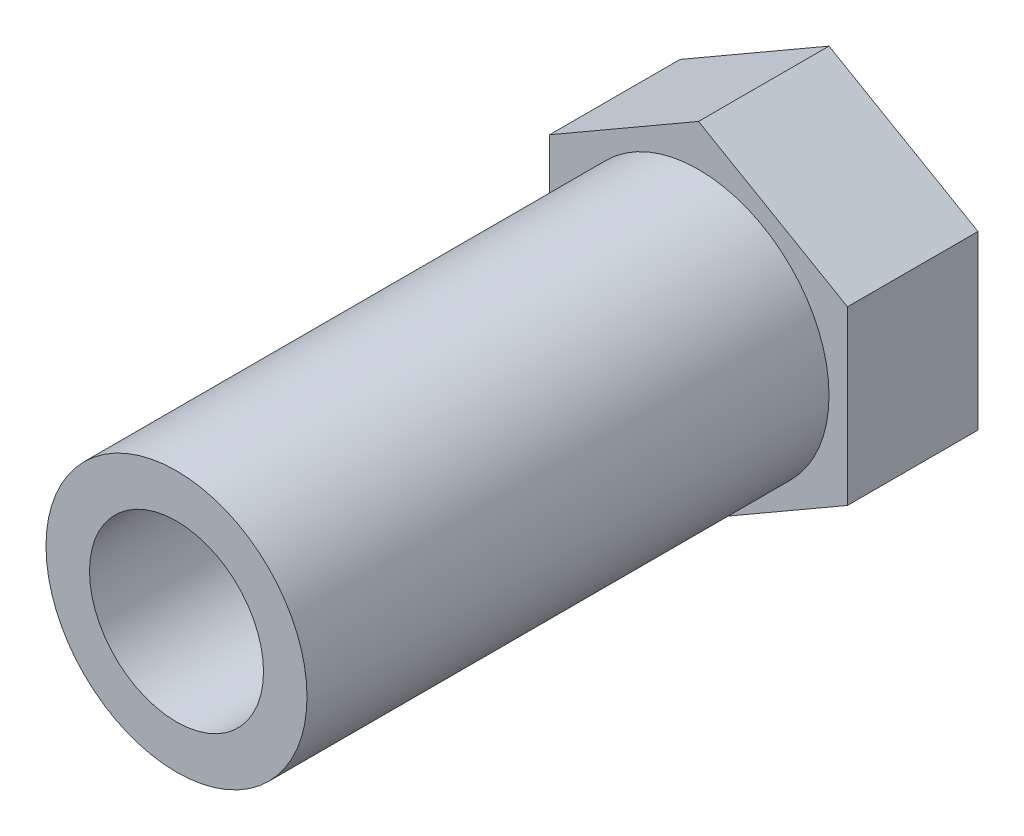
ISO-10303-21;
HEADER;
FILE_DESCRIPTION(('STEP AP214'),'2;1');
FILE_NAME('part.step','',(''),(''),'','','');
FILE_SCHEMA(('AUTOMOTIVE_DESIGN { 1 0 10303 214 1 1 1 1 }'));
ENDSEC;
DATA;
#1=APPLICATION_CONTEXT('core data for automotive mechanical design processes');
#2=APPLICATION_PROTOCOL_DEFINITION('international standard','automotive_design',2000,#1);
#3=PRODUCT_CONTEXT('',#1,'mechanical');
#4=PRODUCT('Part','Part','',(#3));
#5=PRODUCT_RELATED_PRODUCT_CATEGORY('part','',(#4));
#6=PRODUCT_DEFINITION_FORMATION('','',#4);
#7=PRODUCT_DEFINITION_CONTEXT('part definition',#1,'design');
#8=PRODUCT_DEFINITION('design','',#6,#7);
#9=PRODUCT_DEFINITION_SHAPE('','',#8);
#10=(LENGTH_UNIT() NAMED_UNIT(*) SI_UNIT(.MILLI.,.METRE.));
#11=(NAMED_UNIT(*) PLANE_ANGLE_UNIT() SI_UNIT($,.RADIAN.));
#12=(NAMED_UNIT(*) SI_UNIT($,.STERADIAN.) SOLID_ANGLE_UNIT());
#13=UNCERTAINTY_MEASURE_WITH_UNIT(LENGTH_MEASURE(1.E-05),#10,'distance_accuracy_value','');
#14=(GEOMETRIC_REPRESENTATION_CONTEXT(3) GLOBAL_UNCERTAINTY_ASSIGNED_CONTEXT((#13)) GLOBAL_UNIT_ASSIGNED_CONTEXT((#10,
#11,#12)) REPRESENTATION_CONTEXT('',''));
#15=CARTESIAN_POINT('',(0.,0.,0.));
#16=DIRECTION('',(0.,0.,1.));
#17=DIRECTION('',(1.,0.,0.));
#18=AXIS2_PLACEMENT_3D('',#15,#16,#17);
#19=CARTESIAN_POINT('',(6.84999999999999,3.95484934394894,6.));
#20=DIRECTION('',(-0.5,-0.866025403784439,0.));
#21=DIRECTION('',(0.866025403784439,-0.5,0.));
#22=AXIS2_PLACEMENT_3D('',#19,#20,#21);
#23=PLANE('',#22);
#24=DIRECTION('',(-0.866025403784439,0.5,0.));
#25=VECTOR('',#24,1.);
#26=CARTESIAN_POINT('',(6.84999999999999,3.95484934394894,0.));
#27=LINE('',#26,#25);
#28=CARTESIAN_POINT('',(6.84999999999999,3.95484934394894,0.));
#29=VERTEX_POINT('',#28);
#30=CARTESIAN_POINT('',(0.,7.90969868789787,0.));
#31=VERTEX_POINT('',#30);
#32=EDGE_CURVE('E120',#29,#31,#27,.T.);
#33=ORIENTED_EDGE('',*,*,#32,.T.);
#34=DIRECTION('',(0.,0.,-1.));
#35=VECTOR('',#34,1.);
#36=CARTESIAN_POINT('',(0.,7.90969868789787,6.));
#37=LINE('',#36,#35);
#38=CARTESIAN_POINT('',(0.,7.90969868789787,6.));
#39=VERTEX_POINT('',#38);
#40=EDGE_CURVE('E37',#39,#31,#37,.T.);
#41=ORIENTED_EDGE('',*,*,#40,.F.);
#42=DIRECTION('',(-0.866025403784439,0.5,0.));
#43=VECTOR('',#42,1.);
#44=CARTESIAN_POINT('',(6.84999999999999,3.95484934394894,6.));
#45=LINE('',#44,#43);
#46=CARTESIAN_POINT('',(6.84999999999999,3.95484934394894,6.));
#47=VERTEX_POINT('',#46);
#48=EDGE_CURVE('E131',#47,#39,#45,.T.);
#49=ORIENTED_EDGE('',*,*,#48,.F.);
#50=DIRECTION('',(0.,0.,-1.));
#51=VECTOR('',#50,1.);
#52=CARTESIAN_POINT('',(6.84999999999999,3.95484934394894,6.));
#53=LINE('',#52,#51);
#54=EDGE_CURVE('E116',#47,#29,#53,.T.);
#55=ORIENTED_EDGE('',*,*,#54,.T.);
#56=EDGE_LOOP('',(#33,#41,#49,#55));
#57=FACE_BOUND('',#56,.T.);
#58=ADVANCED_FACE('F34',(#57),#23,.F.);
#59=CARTESIAN_POINT('',(0.,7.90969868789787,6.));
#60=DIRECTION('',(0.5,-0.866025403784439,0.));
#61=DIRECTION('',(0.866025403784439,0.5,0.));
#62=AXIS2_PLACEMENT_3D('',#59,#60,#61);
#63=PLANE('',#62);
#64=DIRECTION('',(-0.866025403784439,-0.5,0.));
#65=VECTOR('',#64,1.);
#66=CARTESIAN_POINT('',(0.,7.90969868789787,0.));
#67=LINE('',#66,#65);
#68=CARTESIAN_POINT('',(-6.85,3.95484934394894,0.));
#69=VERTEX_POINT('',#68);
#70=EDGE_CURVE('E123',#31,#69,#67,.T.);
#71=ORIENTED_EDGE('',*,*,#70,.T.);
#72=DIRECTION('',(0.,0.,-1.));
#73=VECTOR('',#72,1.);
#74=CARTESIAN_POINT('',(-6.85,3.95484934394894,6.));
#75=LINE('',#74,#73);
#76=CARTESIAN_POINT('',(-6.85,3.95484934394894,6.));
#77=VERTEX_POINT('',#76);
#78=EDGE_CURVE('E134',#77,#69,#75,.T.);
#79=ORIENTED_EDGE('',*,*,#78,.F.);
#80=DIRECTION('',(-0.866025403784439,-0.5,0.));
#81=VECTOR('',#80,1.);
#82=CARTESIAN_POINT('',(0.,7.90969868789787,6.));
#83=LINE('',#82,#81);
#84=EDGE_CURVE('E89',#39,#77,#83,.T.);
#85=ORIENTED_EDGE('',*,*,#84,.F.);
#86=ORIENTED_EDGE('',*,*,#40,.T.);
#87=EDGE_LOOP('',(#71,#79,#85,#86));
#88=FACE_BOUND('',#87,.T.);
#89=ADVANCED_FACE('F139',(#88),#63,.F.);
#90=CARTESIAN_POINT('',(-6.85,3.95484934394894,6.));
#91=DIRECTION('',(1.,0.,0.));
#92=DIRECTION('',(0.,1.,0.));
#93=AXIS2_PLACEMENT_3D('',#90,#91,#92);
#94=PLANE('',#93);
#95=DIRECTION('',(0.,-1.,0.));
#96=VECTOR('',#95,1.);
#97=CARTESIAN_POINT('',(-6.85,3.95484934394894,0.));
#98=LINE('',#97,#96);
#99=CARTESIAN_POINT('',(-6.85,-3.95484934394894,0.));
#100=VERTEX_POINT('',#99);
#101=EDGE_CURVE('E126',#69,#100,#98,.T.);
#102=ORIENTED_EDGE('',*,*,#101,.T.);
#103=DIRECTION('',(0.,0.,-1.));
#104=VECTOR('',#103,1.);
#105=CARTESIAN_POINT('',(-6.85,-3.95484934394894,6.));
#106=LINE('',#105,#104);
#107=CARTESIAN_POINT('',(-6.85,-3.95484934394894,6.));
#108=VERTEX_POINT('',#107);
#109=EDGE_CURVE('E111',#108,#100,#106,.T.);
#110=ORIENTED_EDGE('',*,*,#109,.F.);
#111=DIRECTION('',(0.,-1.,0.));
#112=VECTOR('',#111,1.);
#113=CARTESIAN_POINT('',(-6.85,3.95484934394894,6.));
#114=LINE('',#113,#112);
#115=EDGE_CURVE('E102',#77,#108,#114,.T.);
#116=ORIENTED_EDGE('',*,*,#115,.F.);
#117=ORIENTED_EDGE('',*,*,#78,.T.);
#118=EDGE_LOOP('',(#102,#110,#116,#117));
#119=FACE_BOUND('',#118,.T.);
#120=ADVANCED_FACE('F145',(#119),#94,.F.);
#121=CARTESIAN_POINT('',(-6.85,-3.95484934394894,6.));
#122=DIRECTION('',(0.5,0.866025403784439,0.));
#123=DIRECTION('',(-0.866025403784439,0.5,0.));
#124=AXIS2_PLACEMENT_3D('',#121,#122,#123);
#125=PLANE('',#124);
#126=DIRECTION('',(0.866025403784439,-0.5,0.));
#127=VECTOR('',#126,1.);
#128=CARTESIAN_POINT('',(-6.85,-3.95484934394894,0.));
#129=LINE('',#128,#127);
#130=CARTESIAN_POINT('',(0.,-7.90969868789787,0.));
#131=VERTEX_POINT('',#130);
#132=EDGE_CURVE('E110',#100,#131,#129,.T.);
#133=ORIENTED_EDGE('',*,*,#132,.T.);
#134=DIRECTION('',(0.,0.,-1.));
#135=VECTOR('',#134,1.);
#136=CARTESIAN_POINT('',(0.,-7.90969868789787,6.));
#137=LINE('',#136,#135);
#138=CARTESIAN_POINT('',(0.,-7.90969868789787,6.));
#139=VERTEX_POINT('',#138);
#140=EDGE_CURVE('E107',#139,#131,#137,.T.);
#141=ORIENTED_EDGE('',*,*,#140,.F.);
#142=DIRECTION('',(0.866025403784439,-0.5,0.));
#143=VECTOR('',#142,1.);
#144=CARTESIAN_POINT('',(-6.85,-3.95484934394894,6.));
#145=LINE('',#144,#143);
#146=EDGE_CURVE('E96',#108,#139,#145,.T.);
#147=ORIENTED_EDGE('',*,*,#146,.F.);
#148=ORIENTED_EDGE('',*,*,#109,.T.);
#149=EDGE_LOOP('',(#133,#141,#147,#148));
#150=FACE_BOUND('',#149,.T.);
#151=ADVANCED_FACE('F108',(#150),#125,.F.);
#152=CARTESIAN_POINT('',(0.,-7.90969868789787,6.));
#153=DIRECTION('',(-0.5,0.866025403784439,0.));
#154=DIRECTION('',(-0.866025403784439,-0.5,0.));
#155=AXIS2_PLACEMENT_3D('',#152,#153,#154);
#156=PLANE('',#155);
#157=DIRECTION('',(0.866025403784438,0.5,0.));
#158=VECTOR('',#157,1.);
#159=CARTESIAN_POINT('',(0.,-7.90969868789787,0.));
#160=LINE('',#159,#158);
#161=CARTESIAN_POINT('',(6.85,-3.95484934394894,0.));
#162=VERTEX_POINT('',#161);
#163=EDGE_CURVE('E74',#131,#162,#160,.T.);
#164=ORIENTED_EDGE('',*,*,#163,.T.);
#165=DIRECTION('',(0.,0.,-1.));
#166=VECTOR('',#165,1.);
#167=CARTESIAN_POINT('',(6.85,-3.95484934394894,6.));
#168=LINE('',#167,#166);
#169=CARTESIAN_POINT('',(6.85,-3.95484934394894,6.));
#170=VERTEX_POINT('',#169);
#171=EDGE_CURVE('E112',#170,#162,#168,.T.);
#172=ORIENTED_EDGE('',*,*,#171,.F.);
#173=DIRECTION('',(0.866025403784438,0.5,0.));
#174=VECTOR('',#173,1.);
#175=CARTESIAN_POINT('',(0.,-7.90969868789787,6.));
#176=LINE('',#175,#174);
#177=EDGE_CURVE('E100',#139,#170,#176,.T.);
#178=ORIENTED_EDGE('',*,*,#177,.F.);
#179=ORIENTED_EDGE('',*,*,#140,.T.);
#180=EDGE_LOOP('',(#164,#172,#178,#179));
#181=FACE_BOUND('',#180,.T.);
#182=ADVANCED_FACE('F114',(#181),#156,.F.);
#183=CARTESIAN_POINT('',(6.85,-3.95484934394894,6.));
#184=DIRECTION('',(-1.,0.,0.));
#185=DIRECTION('',(0.,-1.,0.));
#186=AXIS2_PLACEMENT_3D('',#183,#184,#185);
#187=PLANE('',#186);
#188=DIRECTION('',(0.,1.,0.));
#189=VECTOR('',#188,1.);
#190=CARTESIAN_POINT('',(6.85,-3.95484934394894,0.));
#191=LINE('',#190,#189);
#192=EDGE_CURVE('E80',#162,#29,#191,.T.);
#193=ORIENTED_EDGE('',*,*,#192,.T.);
#194=ORIENTED_EDGE('',*,*,#54,.F.);
#195=DIRECTION('',(0.,1.,0.));
#196=VECTOR('',#195,1.);
#197=CARTESIAN_POINT('',(6.85,-3.95484934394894,6.));
#198=LINE('',#197,#196);
#199=EDGE_CURVE('E51',#170,#47,#198,.T.);
#200=ORIENTED_EDGE('',*,*,#199,.F.);
#201=ORIENTED_EDGE('',*,*,#171,.T.);
#202=EDGE_LOOP('',(#193,#194,#200,#201));
#203=FACE_BOUND('',#202,.T.);
#204=ADVANCED_FACE('F179',(#203),#187,.F.);
#205=CARTESIAN_POINT('',(0.,0.,6.));
#206=DIRECTION('',(0.,0.,1.));
#207=DIRECTION('',(1.,0.,0.));
#208=AXIS2_PLACEMENT_3D('',#205,#206,#207);
#209=PLANE('',#208);
#210=CARTESIAN_POINT('',(0.,0.,6.));
#211=DIRECTION('',(0.,0.,1.));
#212=DIRECTION('',(1.,0.,0.));
#213=AXIS2_PLACEMENT_3D('',#210,#211,#212);
#214=CIRCLE('',#213,6.);
#215=CARTESIAN_POINT('',(6.,0.,6.));
#216=VERTEX_POINT('',#215);
#217=EDGE_CURVE('E11',#216,#216,#214,.T.);
#218=ORIENTED_EDGE('',*,*,#217,.F.);
#219=EDGE_LOOP('',(#218));
#220=FACE_BOUND('',#219,.T.);
#221=ORIENTED_EDGE('',*,*,#48,.T.);
#222=ORIENTED_EDGE('',*,*,#84,.T.);
#223=ORIENTED_EDGE('',*,*,#115,.T.);
#224=ORIENTED_EDGE('',*,*,#146,.T.);
#225=ORIENTED_EDGE('',*,*,#177,.T.);
#226=ORIENTED_EDGE('',*,*,#199,.T.);
#227=EDGE_LOOP('',(#221,#222,#223,#224,#225,#226));
#228=FACE_BOUND('',#227,.T.);
#229=ADVANCED_FACE('F98',(#220,#228),#209,.T.);
#230=CARTESIAN_POINT('',(0.,0.,0.));
#231=DIRECTION('',(0.,0.,1.));
#232=DIRECTION('',(1.,0.,0.));
#233=AXIS2_PLACEMENT_3D('',#230,#231,#232);
#234=PLANE('',#233);
#235=ORIENTED_EDGE('',*,*,#32,.F.);
#236=ORIENTED_EDGE('',*,*,#192,.F.);
#237=ORIENTED_EDGE('',*,*,#163,.F.);
#238=ORIENTED_EDGE('',*,*,#132,.F.);
#239=ORIENTED_EDGE('',*,*,#101,.F.);
#240=ORIENTED_EDGE('',*,*,#70,.F.);
#241=EDGE_LOOP('',(#235,#236,#237,#238,#239,#240));
#242=FACE_BOUND('',#241,.T.);
#243=ADVANCED_FACE('F144',(#242),#234,.F.);
#244=CARTESIAN_POINT('',(0.,0.,30.));
#245=DIRECTION('',(0.,0.,-1.));
#246=DIRECTION('',(-1.,0.,0.));
#247=AXIS2_PLACEMENT_3D('',#244,#245,#246);
#248=CYLINDRICAL_SURFACE('',#247,6.);
#249=CARTESIAN_POINT('',(0.,0.,30.));
#250=DIRECTION('',(0.,0.,1.));
#251=DIRECTION('',(1.,0.,0.));
#252=AXIS2_PLACEMENT_3D('',#249,#250,#251);
#253=CIRCLE('',#252,6.);
#254=CARTESIAN_POINT('',(6.,0.,30.));
#255=VERTEX_POINT('',#254);
#256=EDGE_CURVE('E124',#255,#255,#253,.T.);
#257=ORIENTED_EDGE('',*,*,#256,.F.);
#258=EDGE_LOOP('',(#257));
#259=FACE_BOUND('',#258,.T.);
#260=ORIENTED_EDGE('',*,*,#217,.T.);
#261=EDGE_LOOP('',(#260));
#262=FACE_BOUND('',#261,.T.);
#263=ADVANCED_FACE('F169',(#259,#262),#248,.T.);
#264=CARTESIAN_POINT('',(0.,0.,30.));
#265=DIRECTION('',(0.,0.,1.));
#266=DIRECTION('',(1.,0.,0.));
#267=AXIS2_PLACEMENT_3D('',#264,#265,#266);
#268=PLANE('',#267);
#269=CARTESIAN_POINT('',(0.,0.,30.));
#270=DIRECTION('',(0.,0.,1.));
#271=DIRECTION('',(1.,0.,0.));
#272=AXIS2_PLACEMENT_3D('',#269,#270,#271);
#273=CIRCLE('',#272,4.);
#274=CARTESIAN_POINT('',(4.,0.,30.));
#275=VERTEX_POINT('',#274);
#276=EDGE_CURVE('E152',#275,#275,#273,.T.);
#277=ORIENTED_EDGE('',*,*,#276,.F.);
#278=EDGE_LOOP('',(#277));
#279=FACE_BOUND('',#278,.T.);
#280=ORIENTED_EDGE('',*,*,#256,.T.);
#281=EDGE_LOOP('',(#280));
#282=FACE_BOUND('',#281,.T.);
#283=ADVANCED_FACE('F163',(#279,#282),#268,.T.);
#284=CARTESIAN_POINT('',(0.,0.,6.));
#285=DIRECTION('',(0.,0.,1.));
#286=DIRECTION('',(1.,0.,0.));
#287=AXIS2_PLACEMENT_3D('',#284,#285,#286);
#288=CYLINDRICAL_SURFACE('',#287,4.);
#289=CARTESIAN_POINT('',(0.,0.,6.));
#290=DIRECTION('',(0.,0.,1.));
#291=DIRECTION('',(1.,0.,0.));
#292=AXIS2_PLACEMENT_3D('',#289,#290,#291);
#293=CIRCLE('',#292,4.);
#294=CARTESIAN_POINT('',(4.,0.,6.));
#295=VERTEX_POINT('',#294);
#296=EDGE_CURVE('E151',#295,#295,#293,.T.);
#297=ORIENTED_EDGE('',*,*,#296,.F.);
#298=EDGE_LOOP('',(#297));
#299=FACE_BOUND('',#298,.T.);
#300=ORIENTED_EDGE('',*,*,#276,.T.);
#301=EDGE_LOOP('',(#300));
#302=FACE_BOUND('',#301,.T.);
#303=ADVANCED_FACE('F160',(#299,#302),#288,.F.);
#304=CARTESIAN_POINT('',(0.,0.,6.));
#305=DIRECTION('',(0.,0.,1.));
#306=DIRECTION('',(1.,0.,0.));
#307=AXIS2_PLACEMENT_3D('',#304,#305,#306);
#308=PLANE('',#307);
#309=ORIENTED_EDGE('',*,*,#296,.T.);
#310=EDGE_LOOP('',(#309));
#311=FACE_BOUND('',#310,.T.);
#312=ADVANCED_FACE('F158',(#311),#308,.T.);
#313=CLOSED_SHELL('',(#58,#89,#120,#151,#182,#204,#229,#243,#263,#283,#303,#312));
#314=MANIFOLD_SOLID_BREP('B2',#313);
#315=ADVANCED_BREP_SHAPE_REPRESENTATION('',(#18,#314),#14);
#316=SHAPE_DEFINITION_REPRESENTATION(#9,#315);
ENDSEC;
END-ISO-10303-21;
